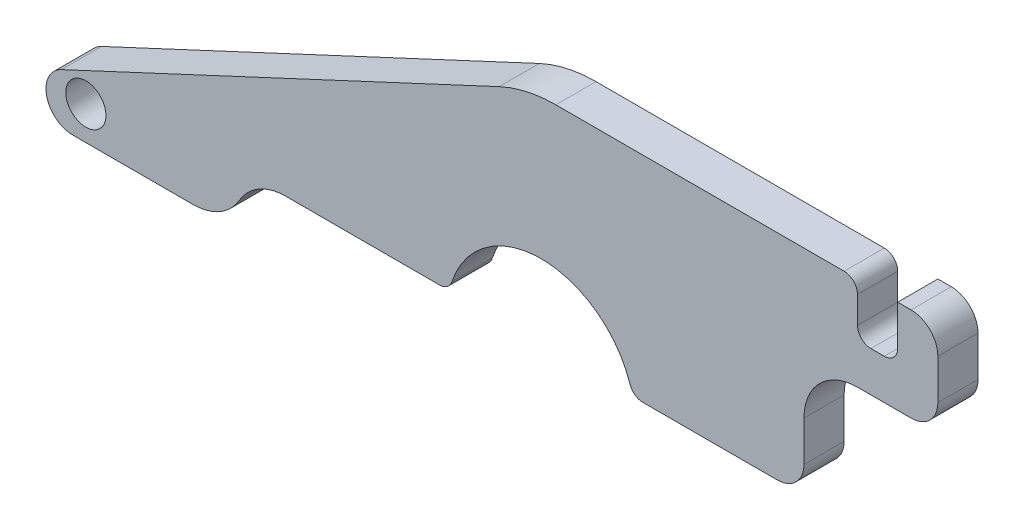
ISO-10303-21;
HEADER;
FILE_DESCRIPTION(('STEP AP214'),'2;1');
FILE_NAME('part.step','',(''),(''),'','','');
FILE_SCHEMA(('AUTOMOTIVE_DESIGN { 1 0 10303 214 1 1 1 1 }'));
ENDSEC;
DATA;
#1=APPLICATION_CONTEXT('core data for automotive mechanical design processes');
#2=APPLICATION_PROTOCOL_DEFINITION('international standard','automotive_design',2000,#1);
#3=PRODUCT_CONTEXT('',#1,'mechanical');
#4=PRODUCT('Part','Part','',(#3));
#5=PRODUCT_RELATED_PRODUCT_CATEGORY('part','',(#4));
#6=PRODUCT_DEFINITION_FORMATION('','',#4);
#7=PRODUCT_DEFINITION_CONTEXT('part definition',#1,'design');
#8=PRODUCT_DEFINITION('design','',#6,#7);
#9=PRODUCT_DEFINITION_SHAPE('','',#8);
#10=(LENGTH_UNIT() NAMED_UNIT(*) SI_UNIT(.MILLI.,.METRE.));
#11=(NAMED_UNIT(*) PLANE_ANGLE_UNIT() SI_UNIT($,.RADIAN.));
#12=(NAMED_UNIT(*) SI_UNIT($,.STERADIAN.) SOLID_ANGLE_UNIT());
#13=UNCERTAINTY_MEASURE_WITH_UNIT(LENGTH_MEASURE(1.E-05),#10,'distance_accuracy_value','');
#14=(GEOMETRIC_REPRESENTATION_CONTEXT(3) GLOBAL_UNCERTAINTY_ASSIGNED_CONTEXT((#13)) GLOBAL_UNIT_ASSIGNED_CONTEXT((#10,
#11,#12)) REPRESENTATION_CONTEXT('',''));
#15=CARTESIAN_POINT('',(0.,0.,0.));
#16=DIRECTION('',(0.,0.,1.));
#17=DIRECTION('',(1.,0.,0.));
#18=AXIS2_PLACEMENT_3D('',#15,#16,#17);
#19=CARTESIAN_POINT('',(4.32006920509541,11.5625,1.5));
#20=DIRECTION('',(0.,-1.,0.));
#21=DIRECTION('',(0.,0.,-1.));
#22=AXIS2_PLACEMENT_3D('',#19,#20,#21);
#23=PLANE('',#22);
#24=DIRECTION('',(0.,0.,-1.));
#25=VECTOR('',#24,1.);
#26=CARTESIAN_POINT('',(4.32006920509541,11.5625,1.5));
#27=LINE('',#26,#25);
#28=CARTESIAN_POINT('',(4.32006920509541,11.5625,0.));
#29=VERTEX_POINT('',#28);
#30=CARTESIAN_POINT('',(4.32006920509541,11.5625,1.5));
#31=VERTEX_POINT('',#30);
#32=EDGE_CURVE('E290',#29,#31,#27,.F.);
#33=ORIENTED_EDGE('',*,*,#32,.T.);
#34=DIRECTION('',(1.,0.,0.));
#35=VECTOR('',#34,1.);
#36=CARTESIAN_POINT('',(4.32006920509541,11.5625,1.5));
#37=LINE('',#36,#35);
#38=CARTESIAN_POINT('',(4.82006920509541,11.5625,1.5));
#39=VERTEX_POINT('',#38);
#40=EDGE_CURVE('E302',#39,#31,#37,.F.);
#41=ORIENTED_EDGE('',*,*,#40,.F.);
#42=DIRECTION('',(0.,0.,-1.));
#43=VECTOR('',#42,1.);
#44=CARTESIAN_POINT('',(4.8200692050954,11.5625,1.5));
#45=LINE('',#44,#43);
#46=CARTESIAN_POINT('',(4.82006920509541,11.5625,0.));
#47=VERTEX_POINT('',#46);
#48=EDGE_CURVE('E286',#39,#47,#45,.T.);
#49=ORIENTED_EDGE('',*,*,#48,.T.);
#50=DIRECTION('',(1.,0.,0.));
#51=VECTOR('',#50,1.);
#52=CARTESIAN_POINT('',(4.32006920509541,11.5625,0.));
#53=LINE('',#52,#51);
#54=EDGE_CURVE('E196',#29,#47,#53,.T.);
#55=ORIENTED_EDGE('',*,*,#54,.F.);
#56=EDGE_LOOP('',(#33,#41,#49,#55));
#57=FACE_BOUND('',#56,.T.);
#58=ADVANCED_FACE('F17',(#57),#23,.F.);
#59=CARTESIAN_POINT('',(-4.2003289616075,6.06250000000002,1.5));
#60=DIRECTION('',(0.,0.,-1.));
#61=DIRECTION('',(-1.,0.,0.));
#62=AXIS2_PLACEMENT_3D('',#59,#60,#61);
#63=CYLINDRICAL_SURFACE('',#62,0.499999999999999);
#64=CARTESIAN_POINT('',(-4.2003289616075,6.06250000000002,1.5));
#65=DIRECTION('',(0.,0.,-1.));
#66=DIRECTION('',(-1.,0.,0.));
#67=AXIS2_PLACEMENT_3D('',#64,#65,#66);
#68=CIRCLE('',#67,0.499999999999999);
#69=CARTESIAN_POINT('',(-4.2003289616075,5.56250000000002,1.5));
#70=VERTEX_POINT('',#69);
#71=CARTESIAN_POINT('',(-4.67528784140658,5.90625000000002,1.5));
#72=VERTEX_POINT('',#71);
#73=EDGE_CURVE('E20',#70,#72,#68,.T.);
#74=ORIENTED_EDGE('',*,*,#73,.T.);
#75=DIRECTION('',(0.,0.,-1.));
#76=VECTOR('',#75,1.);
#77=CARTESIAN_POINT('',(-4.67528784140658,5.90625000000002,1.5));
#78=LINE('',#77,#76);
#79=CARTESIAN_POINT('',(-4.67528784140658,5.90625000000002,0.));
#80=VERTEX_POINT('',#79);
#81=EDGE_CURVE('E192',#72,#80,#78,.T.);
#82=ORIENTED_EDGE('',*,*,#81,.T.);
#83=CARTESIAN_POINT('',(-4.2003289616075,6.06250000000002,0.));
#84=DIRECTION('',(0.,0.,-1.));
#85=DIRECTION('',(-1.,0.,0.));
#86=AXIS2_PLACEMENT_3D('',#83,#84,#85);
#87=CIRCLE('',#86,0.499999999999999);
#88=CARTESIAN_POINT('',(-4.2003289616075,5.56250000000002,0.));
#89=VERTEX_POINT('',#88);
#90=EDGE_CURVE('E280',#89,#80,#87,.T.);
#91=ORIENTED_EDGE('',*,*,#90,.F.);
#92=DIRECTION('',(0.,0.,1.));
#93=VECTOR('',#92,1.);
#94=CARTESIAN_POINT('',(-4.2003289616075,5.56250000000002,1.5));
#95=LINE('',#94,#93);
#96=EDGE_CURVE('E193',#89,#70,#95,.T.);
#97=ORIENTED_EDGE('',*,*,#96,.T.);
#98=EDGE_LOOP('',(#74,#82,#91,#97));
#99=FACE_BOUND('',#98,.T.);
#100=ADVANCED_FACE('F190',(#99),#63,.T.);
#101=CARTESIAN_POINT('',(-11.7996710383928,6.06250000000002,1.5));
#102=DIRECTION('',(0.,0.,-1.));
#103=DIRECTION('',(-1.,0.,0.));
#104=AXIS2_PLACEMENT_3D('',#101,#102,#103);
#105=CYLINDRICAL_SURFACE('',#104,0.5);
#106=CARTESIAN_POINT('',(-11.7996710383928,6.06250000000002,1.5));
#107=DIRECTION('',(0.,0.,-1.));
#108=DIRECTION('',(-1.,0.,0.));
#109=AXIS2_PLACEMENT_3D('',#106,#107,#108);
#110=CIRCLE('',#109,0.5);
#111=CARTESIAN_POINT('',(-11.3247121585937,5.90625000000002,1.5));
#112=VERTEX_POINT('',#111);
#113=CARTESIAN_POINT('',(-11.7996710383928,5.56250000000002,1.5));
#114=VERTEX_POINT('',#113);
#115=EDGE_CURVE('E195',#112,#114,#110,.T.);
#116=ORIENTED_EDGE('',*,*,#115,.T.);
#117=DIRECTION('',(0.,0.,1.));
#118=VECTOR('',#117,1.);
#119=CARTESIAN_POINT('',(-11.7996710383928,5.56250000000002,1.5));
#120=LINE('',#119,#118);
#121=CARTESIAN_POINT('',(-11.7996710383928,5.56250000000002,0.));
#122=VERTEX_POINT('',#121);
#123=EDGE_CURVE('E254',#114,#122,#120,.F.);
#124=ORIENTED_EDGE('',*,*,#123,.T.);
#125=CARTESIAN_POINT('',(-11.7996710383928,6.06250000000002,0.));
#126=DIRECTION('',(0.,0.,-1.));
#127=DIRECTION('',(-1.,0.,0.));
#128=AXIS2_PLACEMENT_3D('',#125,#126,#127);
#129=CIRCLE('',#128,0.5);
#130=CARTESIAN_POINT('',(-11.3247121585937,5.90625000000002,0.));
#131=VERTEX_POINT('',#130);
#132=EDGE_CURVE('E278',#131,#122,#129,.T.);
#133=ORIENTED_EDGE('',*,*,#132,.F.);
#134=DIRECTION('',(0.,0.,-1.));
#135=VECTOR('',#134,1.);
#136=CARTESIAN_POINT('',(-11.3247121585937,5.90625000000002,1.5));
#137=LINE('',#136,#135);
#138=EDGE_CURVE('E204',#131,#112,#137,.F.);
#139=ORIENTED_EDGE('',*,*,#138,.T.);
#140=EDGE_LOOP('',(#116,#124,#133,#139));
#141=FACE_BOUND('',#140,.T.);
#142=ADVANCED_FACE('F430',(#141),#105,.T.);
#143=CARTESIAN_POINT('',(4.32006920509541,12.0625,1.5));
#144=DIRECTION('',(0.,0.,-1.));
#145=DIRECTION('',(-1.,0.,0.));
#146=AXIS2_PLACEMENT_3D('',#143,#144,#145);
#147=CYLINDRICAL_SURFACE('',#146,0.5);
#148=DIRECTION('',(0.,0.,1.));
#149=VECTOR('',#148,1.);
#150=CARTESIAN_POINT('',(3.82006920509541,12.0625,1.5));
#151=LINE('',#150,#149);
#152=CARTESIAN_POINT('',(3.82006920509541,12.0625,0.));
#153=VERTEX_POINT('',#152);
#154=CARTESIAN_POINT('',(3.82006920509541,12.0625,1.5));
#155=VERTEX_POINT('',#154);
#156=EDGE_CURVE('E376',#153,#155,#151,.T.);
#157=ORIENTED_EDGE('',*,*,#156,.T.);
#158=CARTESIAN_POINT('',(4.32006920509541,12.0625,1.5));
#159=DIRECTION('',(0.,0.,-1.));
#160=DIRECTION('',(-1.,0.,0.));
#161=AXIS2_PLACEMENT_3D('',#158,#159,#160);
#162=CIRCLE('',#161,0.5);
#163=EDGE_CURVE('E289',#31,#155,#162,.T.);
#164=ORIENTED_EDGE('',*,*,#163,.F.);
#165=ORIENTED_EDGE('',*,*,#32,.F.);
#166=CARTESIAN_POINT('',(4.32006920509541,12.0625,0.));
#167=DIRECTION('',(0.,0.,-1.));
#168=DIRECTION('',(-1.,0.,0.));
#169=AXIS2_PLACEMENT_3D('',#166,#167,#168);
#170=CIRCLE('',#169,0.5);
#171=EDGE_CURVE('E273',#153,#29,#170,.F.);
#172=ORIENTED_EDGE('',*,*,#171,.F.);
#173=EDGE_LOOP('',(#157,#164,#165,#172));
#174=FACE_BOUND('',#173,.T.);
#175=ADVANCED_FACE('F432',(#174),#147,.F.);
#176=CARTESIAN_POINT('',(3.32006920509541,13.0625,1.5));
#177=DIRECTION('',(0.,0.,-1.));
#178=DIRECTION('',(-1.,0.,0.));
#179=AXIS2_PLACEMENT_3D('',#176,#177,#178);
#180=CYLINDRICAL_SURFACE('',#179,0.5);
#181=CARTESIAN_POINT('',(3.32006920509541,13.0625,1.5));
#182=DIRECTION('',(0.,0.,-1.));
#183=DIRECTION('',(-1.,0.,0.));
#184=AXIS2_PLACEMENT_3D('',#181,#182,#183);
#185=CIRCLE('',#184,0.5);
#186=CARTESIAN_POINT('',(3.32006920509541,13.5625,1.5));
#187=VERTEX_POINT('',#186);
#188=CARTESIAN_POINT('',(3.82006920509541,13.0625,1.5));
#189=VERTEX_POINT('',#188);
#190=EDGE_CURVE('E287',#187,#189,#185,.T.);
#191=ORIENTED_EDGE('',*,*,#190,.T.);
#192=DIRECTION('',(0.,0.,1.));
#193=VECTOR('',#192,1.);
#194=CARTESIAN_POINT('',(3.82006920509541,13.0625,1.5));
#195=LINE('',#194,#193);
#196=CARTESIAN_POINT('',(3.82006920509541,13.0625,0.));
#197=VERTEX_POINT('',#196);
#198=EDGE_CURVE('E372',#189,#197,#195,.F.);
#199=ORIENTED_EDGE('',*,*,#198,.T.);
#200=CARTESIAN_POINT('',(3.32006920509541,13.0625,0.));
#201=DIRECTION('',(0.,0.,-1.));
#202=DIRECTION('',(-1.,0.,0.));
#203=AXIS2_PLACEMENT_3D('',#200,#201,#202);
#204=CIRCLE('',#203,0.5);
#205=CARTESIAN_POINT('',(3.32006920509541,13.5625,0.));
#206=VERTEX_POINT('',#205);
#207=EDGE_CURVE('E276',#206,#197,#204,.T.);
#208=ORIENTED_EDGE('',*,*,#207,.F.);
#209=DIRECTION('',(0.,0.,-1.));
#210=VECTOR('',#209,1.);
#211=CARTESIAN_POINT('',(3.3200692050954,13.5625,1.5));
#212=LINE('',#211,#210);
#213=EDGE_CURVE('E421',#206,#187,#212,.F.);
#214=ORIENTED_EDGE('',*,*,#213,.T.);
#215=EDGE_LOOP('',(#191,#199,#208,#214));
#216=FACE_BOUND('',#215,.T.);
#217=ADVANCED_FACE('F439',(#216),#180,.T.);
#218=CARTESIAN_POINT('',(5.32006920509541,13.5625,1.5));
#219=DIRECTION('',(0.,-1.,0.));
#220=DIRECTION('',(0.,0.,-1.));
#221=AXIS2_PLACEMENT_3D('',#218,#219,#220);
#222=PLANE('',#221);
#223=DIRECTION('',(0.,0.,-1.));
#224=VECTOR('',#223,1.);
#225=CARTESIAN_POINT('',(5.32006920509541,13.5625,1.5));
#226=LINE('',#225,#224);
#227=CARTESIAN_POINT('',(5.32006920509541,13.5625,0.));
#228=VERTEX_POINT('',#227);
#229=CARTESIAN_POINT('',(5.32006920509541,13.5625,1.5));
#230=VERTEX_POINT('',#229);
#231=EDGE_CURVE('E371',#228,#230,#226,.F.);
#232=ORIENTED_EDGE('',*,*,#231,.T.);
#233=DIRECTION('',(1.,0.,0.));
#234=VECTOR('',#233,1.);
#235=CARTESIAN_POINT('',(5.32006920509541,13.5625,1.5));
#236=LINE('',#235,#234);
#237=CARTESIAN_POINT('',(5.8200692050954,13.5625,1.5));
#238=VERTEX_POINT('',#237);
#239=EDGE_CURVE('E35',#238,#230,#236,.F.);
#240=ORIENTED_EDGE('',*,*,#239,.F.);
#241=DIRECTION('',(0.,0.,-1.));
#242=VECTOR('',#241,1.);
#243=CARTESIAN_POINT('',(5.8200692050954,13.5625,1.5));
#244=LINE('',#243,#242);
#245=CARTESIAN_POINT('',(5.8200692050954,13.5625,0.));
#246=VERTEX_POINT('',#245);
#247=EDGE_CURVE('E270',#246,#238,#244,.F.);
#248=ORIENTED_EDGE('',*,*,#247,.F.);
#249=DIRECTION('',(-1.,0.,0.));
#250=VECTOR('',#249,1.);
#251=CARTESIAN_POINT('',(5.82006920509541,13.5625,0.));
#252=LINE('',#251,#250);
#253=EDGE_CURVE('E282',#228,#246,#252,.F.);
#254=ORIENTED_EDGE('',*,*,#253,.F.);
#255=EDGE_LOOP('',(#232,#240,#248,#254));
#256=FACE_BOUND('',#255,.T.);
#257=ADVANCED_FACE('F522',(#256),#222,.F.);
#258=CARTESIAN_POINT('',(4.82006920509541,12.0625,1.5));
#259=DIRECTION('',(0.,0.,-1.));
#260=DIRECTION('',(-1.,0.,0.));
#261=AXIS2_PLACEMENT_3D('',#258,#259,#260);
#262=CYLINDRICAL_SURFACE('',#261,0.5);
#263=ORIENTED_EDGE('',*,*,#48,.F.);
#264=CARTESIAN_POINT('',(4.82006920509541,12.0625,1.5));
#265=DIRECTION('',(0.,0.,-1.));
#266=DIRECTION('',(-1.,0.,0.));
#267=AXIS2_PLACEMENT_3D('',#264,#265,#266);
#268=CIRCLE('',#267,0.5);
#269=CARTESIAN_POINT('',(5.32006920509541,12.0625,1.5));
#270=VERTEX_POINT('',#269);
#271=EDGE_CURVE('E283',#270,#39,#268,.T.);
#272=ORIENTED_EDGE('',*,*,#271,.F.);
#273=DIRECTION('',(0.,0.,-1.));
#274=VECTOR('',#273,1.);
#275=CARTESIAN_POINT('',(5.32006920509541,12.0625,1.5));
#276=LINE('',#275,#274);
#277=CARTESIAN_POINT('',(5.32006920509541,12.0625,0.));
#278=VERTEX_POINT('',#277);
#279=EDGE_CURVE('E362',#270,#278,#276,.T.);
#280=ORIENTED_EDGE('',*,*,#279,.T.);
#281=CARTESIAN_POINT('',(4.82006920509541,12.0625,0.));
#282=DIRECTION('',(0.,0.,-1.));
#283=DIRECTION('',(-1.,0.,0.));
#284=AXIS2_PLACEMENT_3D('',#281,#282,#283);
#285=CIRCLE('',#284,0.5);
#286=EDGE_CURVE('E271',#47,#278,#285,.F.);
#287=ORIENTED_EDGE('',*,*,#286,.F.);
#288=EDGE_LOOP('',(#263,#272,#280,#287));
#289=FACE_BOUND('',#288,.T.);
#290=ADVANCED_FACE('F518',(#289),#262,.F.);
#291=CARTESIAN_POINT('',(5.82006920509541,12.5625,0.));
#292=DIRECTION('',(0.,0.,-1.));
#293=DIRECTION('',(-1.,0.,0.));
#294=AXIS2_PLACEMENT_3D('',#291,#292,#293);
#295=PLANE('',#294);
#296=CARTESIAN_POINT('',(-25.0000000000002,4.81250000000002,0.));
#297=DIRECTION('',(0.,0.,-1.));
#298=DIRECTION('',(-1.,0.,0.));
#299=AXIS2_PLACEMENT_3D('',#296,#297,#298);
#300=CIRCLE('',#299,0.750000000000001);
#301=CARTESIAN_POINT('',(-25.7500000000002,4.81250000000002,0.));
#302=VERTEX_POINT('',#301);
#303=EDGE_CURVE('E234',#302,#302,#300,.F.);
#304=ORIENTED_EDGE('',*,*,#303,.T.);
#305=EDGE_LOOP('',(#304));
#306=FACE_BOUND('',#305,.T.);
#307=ORIENTED_EDGE('',*,*,#286,.T.);
#308=DIRECTION('',(0.,1.,0.));
#309=VECTOR('',#308,1.);
#310=CARTESIAN_POINT('',(5.32006920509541,12.0625,0.));
#311=LINE('',#310,#309);
#312=EDGE_CURVE('E237',#278,#228,#311,.T.);
#313=ORIENTED_EDGE('',*,*,#312,.T.);
#314=ORIENTED_EDGE('',*,*,#253,.T.);
#315=CARTESIAN_POINT('',(5.82006920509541,12.5625,0.));
#316=DIRECTION('',(0.,0.,-1.));
#317=DIRECTION('',(-1.,0.,0.));
#318=AXIS2_PLACEMENT_3D('',#315,#316,#317);
#319=CIRCLE('',#318,1.);
#320=CARTESIAN_POINT('',(6.82006920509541,12.5625,0.));
#321=VERTEX_POINT('',#320);
#322=EDGE_CURVE('E267',#321,#246,#319,.F.);
#323=ORIENTED_EDGE('',*,*,#322,.F.);
#324=DIRECTION('',(0.,-1.,0.));
#325=VECTOR('',#324,1.);
#326=CARTESIAN_POINT('',(6.82006920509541,12.5625,0.));
#327=LINE('',#326,#325);
#328=CARTESIAN_POINT('',(6.82006920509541,11.0625,0.));
#329=VERTEX_POINT('',#328);
#330=EDGE_CURVE('E266',#321,#329,#327,.T.);
#331=ORIENTED_EDGE('',*,*,#330,.T.);
#332=CARTESIAN_POINT('',(5.82006920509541,11.0625,0.));
#333=DIRECTION('',(0.,0.,-1.));
#334=DIRECTION('',(-1.,0.,0.));
#335=AXIS2_PLACEMENT_3D('',#332,#333,#334);
#336=CIRCLE('',#335,0.999999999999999);
#337=CARTESIAN_POINT('',(5.8200692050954,10.0625,0.));
#338=VERTEX_POINT('',#337);
#339=EDGE_CURVE('E263',#338,#329,#336,.F.);
#340=ORIENTED_EDGE('',*,*,#339,.F.);
#341=DIRECTION('',(-1.,0.,0.));
#342=VECTOR('',#341,1.);
#343=CARTESIAN_POINT('',(5.8200692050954,10.0625,0.));
#344=LINE('',#343,#342);
#345=CARTESIAN_POINT('',(3.82006920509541,10.0625,0.));
#346=VERTEX_POINT('',#345);
#347=EDGE_CURVE('E347',#338,#346,#344,.T.);
#348=ORIENTED_EDGE('',*,*,#347,.T.);
#349=CARTESIAN_POINT('',(3.82006920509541,8.06250000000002,0.));
#350=DIRECTION('',(0.,0.,-1.));
#351=DIRECTION('',(-1.,0.,0.));
#352=AXIS2_PLACEMENT_3D('',#349,#350,#351);
#353=CIRCLE('',#352,2.);
#354=CARTESIAN_POINT('',(1.82006920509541,8.06250000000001,0.));
#355=VERTEX_POINT('',#354);
#356=EDGE_CURVE('E259',#346,#355,#353,.F.);
#357=ORIENTED_EDGE('',*,*,#356,.T.);
#358=DIRECTION('',(0.,-1.,0.));
#359=VECTOR('',#358,1.);
#360=CARTESIAN_POINT('',(1.82006920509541,8.0625,0.));
#361=LINE('',#360,#359);
#362=CARTESIAN_POINT('',(1.8200692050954,6.56250000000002,0.));
#363=VERTEX_POINT('',#362);
#364=EDGE_CURVE('E258',#355,#363,#361,.T.);
#365=ORIENTED_EDGE('',*,*,#364,.T.);
#366=CARTESIAN_POINT('',(0.820069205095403,6.56250000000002,0.));
#367=DIRECTION('',(0.,0.,-1.));
#368=DIRECTION('',(-1.,0.,0.));
#369=AXIS2_PLACEMENT_3D('',#366,#367,#368);
#370=CIRCLE('',#369,1.);
#371=CARTESIAN_POINT('',(0.820069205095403,5.56250000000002,0.));
#372=VERTEX_POINT('',#371);
#373=EDGE_CURVE('E255',#372,#363,#370,.F.);
#374=ORIENTED_EDGE('',*,*,#373,.F.);
#375=DIRECTION('',(1.,0.,0.));
#376=VECTOR('',#375,1.);
#377=CARTESIAN_POINT('',(0.820069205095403,5.56250000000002,0.));
#378=LINE('',#377,#376);
#379=EDGE_CURVE('E336',#372,#89,#378,.F.);
#380=ORIENTED_EDGE('',*,*,#379,.T.);
#381=ORIENTED_EDGE('',*,*,#90,.T.);
#382=CARTESIAN_POINT('',(-8.00000000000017,4.81250000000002,0.));
#383=DIRECTION('',(0.,0.,-1.));
#384=DIRECTION('',(-1.,0.,0.));
#385=AXIS2_PLACEMENT_3D('',#382,#383,#384);
#386=CIRCLE('',#385,3.5);
#387=EDGE_CURVE('E203',#80,#131,#386,.F.);
#388=ORIENTED_EDGE('',*,*,#387,.T.);
#389=ORIENTED_EDGE('',*,*,#132,.T.);
#390=DIRECTION('',(-1.,0.,0.));
#391=VECTOR('',#390,1.);
#392=CARTESIAN_POINT('',(-11.7996710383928,5.56250000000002,0.));
#393=LINE('',#392,#391);
#394=CARTESIAN_POINT('',(-17.5358983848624,5.56250000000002,0.));
#395=VERTEX_POINT('',#394);
#396=EDGE_CURVE('E329',#122,#395,#393,.T.);
#397=ORIENTED_EDGE('',*,*,#396,.T.);
#398=CARTESIAN_POINT('',(-17.5358983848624,3.56250000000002,0.));
#399=DIRECTION('',(0.,0.,-1.));
#400=DIRECTION('',(-1.,0.,0.));
#401=AXIS2_PLACEMENT_3D('',#398,#399,#400);
#402=CIRCLE('',#401,2.);
#403=CARTESIAN_POINT('',(-19.2679491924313,4.56250000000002,0.));
#404=VERTEX_POINT('',#403);
#405=EDGE_CURVE('E249',#395,#404,#402,.F.);
#406=ORIENTED_EDGE('',*,*,#405,.T.);
#407=CARTESIAN_POINT('',(-21.0000000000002,5.56250000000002,0.));
#408=DIRECTION('',(0.,0.,-1.));
#409=DIRECTION('',(-1.,0.,0.));
#410=AXIS2_PLACEMENT_3D('',#407,#408,#409);
#411=CIRCLE('',#410,2.);
#412=CARTESIAN_POINT('',(-21.0000000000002,3.56250000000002,0.));
#413=VERTEX_POINT('',#412);
#414=EDGE_CURVE('E246',#413,#404,#411,.F.);
#415=ORIENTED_EDGE('',*,*,#414,.F.);
#416=DIRECTION('',(-1.,0.,0.));
#417=VECTOR('',#416,1.);
#418=CARTESIAN_POINT('',(-25.4892914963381,3.56250000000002,0.));
#419=LINE('',#418,#417);
#420=CARTESIAN_POINT('',(-25.4892914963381,3.56250000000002,0.));
#421=VERTEX_POINT('',#420);
#422=EDGE_CURVE('E380',#413,#421,#419,.T.);
#423=ORIENTED_EDGE('',*,*,#422,.T.);
#424=CARTESIAN_POINT('',(-25.4892914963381,4.56250000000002,0.));
#425=DIRECTION('',(0.,0.,-1.));
#426=DIRECTION('',(-1.,0.,0.));
#427=AXIS2_PLACEMENT_3D('',#424,#425,#426);
#428=CIRCLE('',#427,1.);
#429=CARTESIAN_POINT('',(-25.9119097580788,5.46880778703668,0.));
#430=VERTEX_POINT('',#429);
#431=EDGE_CURVE('E242',#430,#421,#428,.F.);
#432=ORIENTED_EDGE('',*,*,#431,.F.);
#433=DIRECTION('',(0.906307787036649,0.422618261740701,0.));
#434=VECTOR('',#433,1.);
#435=CARTESIAN_POINT('',(-25.9119097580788,5.4688077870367,0.));
#436=LINE('',#435,#434);
#437=CARTESIAN_POINT('',(-9.55954879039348,13.0940389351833,0.));
#438=VERTEX_POINT('',#437);
#439=EDGE_CURVE('E241',#430,#438,#436,.T.);
#440=ORIENTED_EDGE('',*,*,#439,.T.);
#441=CARTESIAN_POINT('',(-7.44645748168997,8.56250000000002,0.));
#442=DIRECTION('',(0.,0.,-1.));
#443=DIRECTION('',(-1.,0.,0.));
#444=AXIS2_PLACEMENT_3D('',#441,#442,#443);
#445=CIRCLE('',#444,5.);
#446=CARTESIAN_POINT('',(-7.44645748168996,13.5625,0.));
#447=VERTEX_POINT('',#446);
#448=EDGE_CURVE('E238',#447,#438,#445,.F.);
#449=ORIENTED_EDGE('',*,*,#448,.F.);
#450=DIRECTION('',(1.,0.,0.));
#451=VECTOR('',#450,1.);
#452=CARTESIAN_POINT('',(-7.44645748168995,13.5625,0.));
#453=LINE('',#452,#451);
#454=EDGE_CURVE('E373',#447,#206,#453,.T.);
#455=ORIENTED_EDGE('',*,*,#454,.T.);
#456=ORIENTED_EDGE('',*,*,#207,.T.);
#457=DIRECTION('',(0.,-1.,0.));
#458=VECTOR('',#457,1.);
#459=CARTESIAN_POINT('',(3.82006920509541,13.0625,0.));
#460=LINE('',#459,#458);
#461=EDGE_CURVE('E368',#197,#153,#460,.T.);
#462=ORIENTED_EDGE('',*,*,#461,.T.);
#463=ORIENTED_EDGE('',*,*,#171,.T.);
#464=ORIENTED_EDGE('',*,*,#54,.T.);
#465=EDGE_LOOP('',(#307,#313,#314,#323,#331,#340,#348,#357,#365,#374,#380,#381,#388,#389,#397,
#406,#415,#423,#432,#440,#449,#455,#456,#462,#463,#464));
#466=FACE_BOUND('',#465,.T.);
#467=ADVANCED_FACE('F392',(#306,#466),#295,.T.);
#468=CARTESIAN_POINT('',(5.82006920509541,12.5625,1.5));
#469=DIRECTION('',(0.,0.,-1.));
#470=DIRECTION('',(-1.,0.,0.));
#471=AXIS2_PLACEMENT_3D('',#468,#469,#470);
#472=CYLINDRICAL_SURFACE('',#471,1.);
#473=CARTESIAN_POINT('',(5.82006920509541,12.5625,1.5));
#474=DIRECTION('',(0.,0.,-1.));
#475=DIRECTION('',(-1.,0.,0.));
#476=AXIS2_PLACEMENT_3D('',#473,#474,#475);
#477=CIRCLE('',#476,1.);
#478=CARTESIAN_POINT('',(6.82006920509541,12.5625,1.5));
#479=VERTEX_POINT('',#478);
#480=EDGE_CURVE('E231',#238,#479,#477,.T.);
#481=ORIENTED_EDGE('',*,*,#480,.T.);
#482=DIRECTION('',(0.,0.,1.));
#483=VECTOR('',#482,1.);
#484=CARTESIAN_POINT('',(6.82006920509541,12.5625,1.5));
#485=LINE('',#484,#483);
#486=EDGE_CURVE('E352',#479,#321,#485,.F.);
#487=ORIENTED_EDGE('',*,*,#486,.T.);
#488=ORIENTED_EDGE('',*,*,#322,.T.);
#489=ORIENTED_EDGE('',*,*,#247,.T.);
#490=EDGE_LOOP('',(#481,#487,#488,#489));
#491=FACE_BOUND('',#490,.T.);
#492=ADVANCED_FACE('F512',(#491),#472,.T.);
#493=CARTESIAN_POINT('',(6.82006920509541,12.5625,1.5));
#494=DIRECTION('',(-1.,0.,0.));
#495=DIRECTION('',(0.,-1.,0.));
#496=AXIS2_PLACEMENT_3D('',#493,#494,#495);
#497=PLANE('',#496);
#498=ORIENTED_EDGE('',*,*,#486,.F.);
#499=DIRECTION('',(0.,1.,0.));
#500=VECTOR('',#499,1.);
#501=CARTESIAN_POINT('',(6.82006920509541,12.5625,1.5));
#502=LINE('',#501,#500);
#503=CARTESIAN_POINT('',(6.82006920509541,11.0625,1.5));
#504=VERTEX_POINT('',#503);
#505=EDGE_CURVE('E230',#479,#504,#502,.F.);
#506=ORIENTED_EDGE('',*,*,#505,.T.);
#507=DIRECTION('',(0.,0.,-1.));
#508=VECTOR('',#507,1.);
#509=CARTESIAN_POINT('',(6.82006920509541,11.0625,1.5));
#510=LINE('',#509,#508);
#511=EDGE_CURVE('E265',#329,#504,#510,.F.);
#512=ORIENTED_EDGE('',*,*,#511,.F.);
#513=ORIENTED_EDGE('',*,*,#330,.F.);
#514=EDGE_LOOP('',(#498,#506,#512,#513));
#515=FACE_BOUND('',#514,.T.);
#516=ADVANCED_FACE('F396',(#515),#497,.F.);
#517=CARTESIAN_POINT('',(5.82006920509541,11.0625,1.5));
#518=DIRECTION('',(0.,0.,-1.));
#519=DIRECTION('',(-1.,0.,0.));
#520=AXIS2_PLACEMENT_3D('',#517,#518,#519);
#521=CYLINDRICAL_SURFACE('',#520,0.999999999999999);
#522=CARTESIAN_POINT('',(5.82006920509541,11.0625,1.5));
#523=DIRECTION('',(0.,0.,-1.));
#524=DIRECTION('',(-1.,0.,0.));
#525=AXIS2_PLACEMENT_3D('',#522,#523,#524);
#526=CIRCLE('',#525,0.999999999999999);
#527=CARTESIAN_POINT('',(5.8200692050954,10.0625,1.5));
#528=VERTEX_POINT('',#527);
#529=EDGE_CURVE('E227',#504,#528,#526,.T.);
#530=ORIENTED_EDGE('',*,*,#529,.T.);
#531=DIRECTION('',(0.,0.,1.));
#532=VECTOR('',#531,1.);
#533=CARTESIAN_POINT('',(5.8200692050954,10.0625,1.5));
#534=LINE('',#533,#532);
#535=EDGE_CURVE('E348',#528,#338,#534,.F.);
#536=ORIENTED_EDGE('',*,*,#535,.T.);
#537=ORIENTED_EDGE('',*,*,#339,.T.);
#538=ORIENTED_EDGE('',*,*,#511,.T.);
#539=EDGE_LOOP('',(#530,#536,#537,#538));
#540=FACE_BOUND('',#539,.T.);
#541=ADVANCED_FACE('F400',(#540),#521,.T.);
#542=CARTESIAN_POINT('',(5.8200692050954,10.0625,1.5));
#543=DIRECTION('',(0.,1.,0.));
#544=DIRECTION('',(-1.,0.,0.));
#545=AXIS2_PLACEMENT_3D('',#542,#543,#544);
#546=PLANE('',#545);
#547=ORIENTED_EDGE('',*,*,#535,.F.);
#548=DIRECTION('',(-1.,0.,0.));
#549=VECTOR('',#548,1.);
#550=CARTESIAN_POINT('',(5.82006920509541,10.0625,1.5));
#551=LINE('',#550,#549);
#552=CARTESIAN_POINT('',(3.82006920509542,10.0625,1.5));
#553=VERTEX_POINT('',#552);
#554=EDGE_CURVE('E226',#528,#553,#551,.T.);
#555=ORIENTED_EDGE('',*,*,#554,.T.);
#556=DIRECTION('',(0.,0.,-1.));
#557=VECTOR('',#556,1.);
#558=CARTESIAN_POINT('',(3.82006920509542,10.0625,1.5));
#559=LINE('',#558,#557);
#560=EDGE_CURVE('E262',#553,#346,#559,.T.);
#561=ORIENTED_EDGE('',*,*,#560,.T.);
#562=ORIENTED_EDGE('',*,*,#347,.F.);
#563=EDGE_LOOP('',(#547,#555,#561,#562));
#564=FACE_BOUND('',#563,.T.);
#565=ADVANCED_FACE('F504',(#564),#546,.F.);
#566=CARTESIAN_POINT('',(3.82006920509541,8.06250000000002,1.5));
#567=DIRECTION('',(0.,0.,-1.));
#568=DIRECTION('',(-1.,0.,0.));
#569=AXIS2_PLACEMENT_3D('',#566,#567,#568);
#570=CYLINDRICAL_SURFACE('',#569,2.);
#571=ORIENTED_EDGE('',*,*,#560,.F.);
#572=CARTESIAN_POINT('',(3.82006920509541,8.06250000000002,1.5));
#573=DIRECTION('',(0.,0.,-1.));
#574=DIRECTION('',(-1.,0.,0.));
#575=AXIS2_PLACEMENT_3D('',#572,#573,#574);
#576=CIRCLE('',#575,2.);
#577=CARTESIAN_POINT('',(1.82006920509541,8.06250000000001,1.5));
#578=VERTEX_POINT('',#577);
#579=EDGE_CURVE('E223',#553,#578,#576,.F.);
#580=ORIENTED_EDGE('',*,*,#579,.T.);
#581=DIRECTION('',(0.,0.,1.));
#582=VECTOR('',#581,1.);
#583=CARTESIAN_POINT('',(1.82006920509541,8.0625,1.5));
#584=LINE('',#583,#582);
#585=EDGE_CURVE('E261',#578,#355,#584,.F.);
#586=ORIENTED_EDGE('',*,*,#585,.T.);
#587=ORIENTED_EDGE('',*,*,#356,.F.);
#588=EDGE_LOOP('',(#571,#580,#586,#587));
#589=FACE_BOUND('',#588,.T.);
#590=ADVANCED_FACE('F500',(#589),#570,.F.);
#591=CARTESIAN_POINT('',(1.82006920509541,8.0625,1.5));
#592=DIRECTION('',(-1.,0.,0.));
#593=DIRECTION('',(0.,-1.,0.));
#594=AXIS2_PLACEMENT_3D('',#591,#592,#593);
#595=PLANE('',#594);
#596=ORIENTED_EDGE('',*,*,#585,.F.);
#597=DIRECTION('',(0.,1.,0.));
#598=VECTOR('',#597,1.);
#599=CARTESIAN_POINT('',(1.82006920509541,12.5625,1.5));
#600=LINE('',#599,#598);
#601=CARTESIAN_POINT('',(1.82006920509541,6.56250000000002,1.5));
#602=VERTEX_POINT('',#601);
#603=EDGE_CURVE('E222',#578,#602,#600,.F.);
#604=ORIENTED_EDGE('',*,*,#603,.T.);
#605=DIRECTION('',(0.,0.,-1.));
#606=VECTOR('',#605,1.);
#607=CARTESIAN_POINT('',(1.8200692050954,6.56250000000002,1.5));
#608=LINE('',#607,#606);
#609=EDGE_CURVE('E257',#363,#602,#608,.F.);
#610=ORIENTED_EDGE('',*,*,#609,.F.);
#611=ORIENTED_EDGE('',*,*,#364,.F.);
#612=EDGE_LOOP('',(#596,#604,#610,#611));
#613=FACE_BOUND('',#612,.T.);
#614=ADVANCED_FACE('F496',(#613),#595,.F.);
#615=CARTESIAN_POINT('',(0.820069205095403,6.56250000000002,1.5));
#616=DIRECTION('',(0.,0.,-1.));
#617=DIRECTION('',(-1.,0.,0.));
#618=AXIS2_PLACEMENT_3D('',#615,#616,#617);
#619=CYLINDRICAL_SURFACE('',#618,1.);
#620=CARTESIAN_POINT('',(0.820069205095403,6.56250000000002,1.5));
#621=DIRECTION('',(0.,0.,-1.));
#622=DIRECTION('',(-1.,0.,0.));
#623=AXIS2_PLACEMENT_3D('',#620,#621,#622);
#624=CIRCLE('',#623,1.);
#625=CARTESIAN_POINT('',(0.820069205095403,5.56250000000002,1.5));
#626=VERTEX_POINT('',#625);
#627=EDGE_CURVE('E215',#602,#626,#624,.T.);
#628=ORIENTED_EDGE('',*,*,#627,.T.);
#629=DIRECTION('',(0.,0.,1.));
#630=VECTOR('',#629,1.);
#631=CARTESIAN_POINT('',(0.820069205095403,5.56250000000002,1.5));
#632=LINE('',#631,#630);
#633=EDGE_CURVE('E338',#626,#372,#632,.F.);
#634=ORIENTED_EDGE('',*,*,#633,.T.);
#635=ORIENTED_EDGE('',*,*,#373,.T.);
#636=ORIENTED_EDGE('',*,*,#609,.T.);
#637=EDGE_LOOP('',(#628,#634,#635,#636));
#638=FACE_BOUND('',#637,.T.);
#639=ADVANCED_FACE('F492',(#638),#619,.T.);
#640=CARTESIAN_POINT('',(0.820069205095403,5.56250000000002,1.5));
#641=DIRECTION('',(0.,1.,0.));
#642=DIRECTION('',(0.,0.,1.));
#643=AXIS2_PLACEMENT_3D('',#640,#641,#642);
#644=PLANE('',#643);
#645=ORIENTED_EDGE('',*,*,#633,.F.);
#646=DIRECTION('',(-1.,0.,0.));
#647=VECTOR('',#646,1.);
#648=CARTESIAN_POINT('',(5.82006920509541,5.56250000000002,1.5));
#649=LINE('',#648,#647);
#650=EDGE_CURVE('E210',#626,#70,#649,.T.);
#651=ORIENTED_EDGE('',*,*,#650,.T.);
#652=ORIENTED_EDGE('',*,*,#96,.F.);
#653=ORIENTED_EDGE('',*,*,#379,.F.);
#654=EDGE_LOOP('',(#645,#651,#652,#653));
#655=FACE_BOUND('',#654,.T.);
#656=ADVANCED_FACE('F489',(#655),#644,.F.);
#657=CARTESIAN_POINT('',(-8.00000000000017,4.81250000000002,1.5));
#658=DIRECTION('',(0.,0.,-1.));
#659=DIRECTION('',(-1.,0.,0.));
#660=AXIS2_PLACEMENT_3D('',#657,#658,#659);
#661=CYLINDRICAL_SURFACE('',#660,3.5);
#662=ORIENTED_EDGE('',*,*,#81,.F.);
#663=CARTESIAN_POINT('',(-8.00000000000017,4.81250000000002,1.5));
#664=DIRECTION('',(0.,0.,-1.));
#665=DIRECTION('',(-1.,0.,0.));
#666=AXIS2_PLACEMENT_3D('',#663,#664,#665);
#667=CIRCLE('',#666,3.5);
#668=EDGE_CURVE('E201',#72,#112,#667,.F.);
#669=ORIENTED_EDGE('',*,*,#668,.T.);
#670=ORIENTED_EDGE('',*,*,#138,.F.);
#671=ORIENTED_EDGE('',*,*,#387,.F.);
#672=EDGE_LOOP('',(#662,#669,#670,#671));
#673=FACE_BOUND('',#672,.T.);
#674=ADVANCED_FACE('F200',(#673),#661,.F.);
#675=CARTESIAN_POINT('',(-11.7996710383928,5.56250000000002,1.5));
#676=DIRECTION('',(0.,1.,0.));
#677=DIRECTION('',(-1.,0.,0.));
#678=AXIS2_PLACEMENT_3D('',#675,#676,#677);
#679=PLANE('',#678);
#680=ORIENTED_EDGE('',*,*,#123,.F.);
#681=DIRECTION('',(-1.,0.,0.));
#682=VECTOR('',#681,1.);
#683=CARTESIAN_POINT('',(5.82006920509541,5.56250000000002,1.5));
#684=LINE('',#683,#682);
#685=CARTESIAN_POINT('',(-17.5358983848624,5.56250000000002,1.5));
#686=VERTEX_POINT('',#685);
#687=EDGE_CURVE('E209',#114,#686,#684,.T.);
#688=ORIENTED_EDGE('',*,*,#687,.T.);
#689=DIRECTION('',(0.,0.,-1.));
#690=VECTOR('',#689,1.);
#691=CARTESIAN_POINT('',(-17.5358983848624,5.56250000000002,1.5));
#692=LINE('',#691,#690);
#693=EDGE_CURVE('E252',#686,#395,#692,.T.);
#694=ORIENTED_EDGE('',*,*,#693,.T.);
#695=ORIENTED_EDGE('',*,*,#396,.F.);
#696=EDGE_LOOP('',(#680,#688,#694,#695));
#697=FACE_BOUND('',#696,.T.);
#698=ADVANCED_FACE('F327',(#697),#679,.F.);
#699=CARTESIAN_POINT('',(-17.5358983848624,3.56250000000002,1.5));
#700=DIRECTION('',(0.,0.,-1.));
#701=DIRECTION('',(-1.,0.,0.));
#702=AXIS2_PLACEMENT_3D('',#699,#700,#701);
#703=CYLINDRICAL_SURFACE('',#702,2.);
#704=ORIENTED_EDGE('',*,*,#693,.F.);
#705=CARTESIAN_POINT('',(-17.5358983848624,3.56250000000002,1.5));
#706=DIRECTION('',(0.,0.,-1.));
#707=DIRECTION('',(-1.,0.,0.));
#708=AXIS2_PLACEMENT_3D('',#705,#706,#707);
#709=CIRCLE('',#708,2.);
#710=CARTESIAN_POINT('',(-19.2679491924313,4.56250000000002,1.5));
#711=VERTEX_POINT('',#710);
#712=EDGE_CURVE('E213',#686,#711,#709,.F.);
#713=ORIENTED_EDGE('',*,*,#712,.T.);
#714=DIRECTION('',(0.,0.,-1.));
#715=VECTOR('',#714,1.);
#716=CARTESIAN_POINT('',(-19.2679491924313,4.56250000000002,1.5));
#717=LINE('',#716,#715);
#718=EDGE_CURVE('E248',#404,#711,#717,.F.);
#719=ORIENTED_EDGE('',*,*,#718,.F.);
#720=ORIENTED_EDGE('',*,*,#405,.F.);
#721=EDGE_LOOP('',(#704,#713,#719,#720));
#722=FACE_BOUND('',#721,.T.);
#723=ADVANCED_FACE('F322',(#722),#703,.F.);
#724=CARTESIAN_POINT('',(-21.0000000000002,5.56250000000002,1.5));
#725=DIRECTION('',(0.,0.,-1.));
#726=DIRECTION('',(-1.,0.,0.));
#727=AXIS2_PLACEMENT_3D('',#724,#725,#726);
#728=CYLINDRICAL_SURFACE('',#727,2.);
#729=CARTESIAN_POINT('',(-21.0000000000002,5.56250000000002,1.5));
#730=DIRECTION('',(0.,0.,-1.));
#731=DIRECTION('',(-1.,0.,0.));
#732=AXIS2_PLACEMENT_3D('',#729,#730,#731);
#733=CIRCLE('',#732,2.);
#734=CARTESIAN_POINT('',(-21.0000000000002,3.56250000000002,1.5));
#735=VERTEX_POINT('',#734);
#736=EDGE_CURVE('E311',#711,#735,#733,.T.);
#737=ORIENTED_EDGE('',*,*,#736,.T.);
#738=DIRECTION('',(0.,0.,1.));
#739=VECTOR('',#738,1.);
#740=CARTESIAN_POINT('',(-21.0000000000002,3.56250000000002,1.5));
#741=LINE('',#740,#739);
#742=EDGE_CURVE('E382',#735,#413,#741,.F.);
#743=ORIENTED_EDGE('',*,*,#742,.T.);
#744=ORIENTED_EDGE('',*,*,#414,.T.);
#745=ORIENTED_EDGE('',*,*,#718,.T.);
#746=EDGE_LOOP('',(#737,#743,#744,#745));
#747=FACE_BOUND('',#746,.T.);
#748=ADVANCED_FACE('F428',(#747),#728,.T.);
#749=CARTESIAN_POINT('',(-25.4892914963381,3.56250000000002,1.5));
#750=DIRECTION('',(0.,1.,0.));
#751=DIRECTION('',(-1.,0.,0.));
#752=AXIS2_PLACEMENT_3D('',#749,#750,#751);
#753=PLANE('',#752);
#754=ORIENTED_EDGE('',*,*,#742,.F.);
#755=DIRECTION('',(-1.,0.,0.));
#756=VECTOR('',#755,1.);
#757=CARTESIAN_POINT('',(5.82006920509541,3.56250000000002,1.5));
#758=LINE('',#757,#756);
#759=CARTESIAN_POINT('',(-25.4892914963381,3.56250000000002,1.5));
#760=VERTEX_POINT('',#759);
#761=EDGE_CURVE('E310',#735,#760,#758,.T.);
#762=ORIENTED_EDGE('',*,*,#761,.T.);
#763=DIRECTION('',(0.,0.,-1.));
#764=VECTOR('',#763,1.);
#765=CARTESIAN_POINT('',(-25.4892914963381,3.56250000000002,1.5));
#766=LINE('',#765,#764);
#767=EDGE_CURVE('E245',#421,#760,#766,.F.);
#768=ORIENTED_EDGE('',*,*,#767,.F.);
#769=ORIENTED_EDGE('',*,*,#422,.F.);
#770=EDGE_LOOP('',(#754,#762,#768,#769));
#771=FACE_BOUND('',#770,.T.);
#772=ADVANCED_FACE('F476',(#771),#753,.F.);
#773=CARTESIAN_POINT('',(-25.4892914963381,4.56250000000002,1.5));
#774=DIRECTION('',(0.,0.,-1.));
#775=DIRECTION('',(-1.,0.,0.));
#776=AXIS2_PLACEMENT_3D('',#773,#774,#775);
#777=CYLINDRICAL_SURFACE('',#776,1.);
#778=DIRECTION('',(0.,0.,1.));
#779=VECTOR('',#778,1.);
#780=CARTESIAN_POINT('',(-25.9119097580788,5.4688077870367,1.5));
#781=LINE('',#780,#779);
#782=CARTESIAN_POINT('',(-25.9119097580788,5.46880778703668,1.5));
#783=VERTEX_POINT('',#782);
#784=EDGE_CURVE('E244',#783,#430,#781,.F.);
#785=ORIENTED_EDGE('',*,*,#784,.T.);
#786=ORIENTED_EDGE('',*,*,#431,.T.);
#787=ORIENTED_EDGE('',*,*,#767,.T.);
#788=CARTESIAN_POINT('',(-25.4892914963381,4.56250000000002,1.5));
#789=DIRECTION('',(0.,0.,-1.));
#790=DIRECTION('',(-1.,0.,0.));
#791=AXIS2_PLACEMENT_3D('',#788,#789,#790);
#792=CIRCLE('',#791,1.);
#793=EDGE_CURVE('E309',#760,#783,#792,.T.);
#794=ORIENTED_EDGE('',*,*,#793,.T.);
#795=EDGE_LOOP('',(#785,#786,#787,#794));
#796=FACE_BOUND('',#795,.T.);
#797=ADVANCED_FACE('F472',(#796),#777,.T.);
#798=CARTESIAN_POINT('',(-25.9119097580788,5.4688077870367,1.5));
#799=DIRECTION('',(0.422618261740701,-0.906307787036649,0.));
#800=DIRECTION('',(0.906307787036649,0.422618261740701,0.));
#801=AXIS2_PLACEMENT_3D('',#798,#799,#800);
#802=PLANE('',#801);
#803=ORIENTED_EDGE('',*,*,#784,.F.);
#804=DIRECTION('',(0.906307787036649,0.422618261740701,0.));
#805=VECTOR('',#804,1.);
#806=CARTESIAN_POINT('',(-25.9119097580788,5.4688077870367,1.5));
#807=LINE('',#806,#805);
#808=CARTESIAN_POINT('',(-9.55954879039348,13.0940389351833,1.5));
#809=VERTEX_POINT('',#808);
#810=EDGE_CURVE('E308',#783,#809,#807,.T.);
#811=ORIENTED_EDGE('',*,*,#810,.T.);
#812=DIRECTION('',(0.,0.,-1.));
#813=VECTOR('',#812,1.);
#814=CARTESIAN_POINT('',(-9.55954879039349,13.0940389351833,1.5));
#815=LINE('',#814,#813);
#816=EDGE_CURVE('E240',#438,#809,#815,.F.);
#817=ORIENTED_EDGE('',*,*,#816,.F.);
#818=ORIENTED_EDGE('',*,*,#439,.F.);
#819=EDGE_LOOP('',(#803,#811,#817,#818));
#820=FACE_BOUND('',#819,.T.);
#821=ADVANCED_FACE('F468',(#820),#802,.F.);
#822=CARTESIAN_POINT('',(-7.44645748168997,8.56250000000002,1.5));
#823=DIRECTION('',(0.,0.,-1.));
#824=DIRECTION('',(-1.,0.,0.));
#825=AXIS2_PLACEMENT_3D('',#822,#823,#824);
#826=CYLINDRICAL_SURFACE('',#825,5.);
#827=CARTESIAN_POINT('',(-7.44645748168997,8.56250000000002,1.5));
#828=DIRECTION('',(0.,0.,-1.));
#829=DIRECTION('',(-1.,0.,0.));
#830=AXIS2_PLACEMENT_3D('',#827,#828,#829);
#831=CIRCLE('',#830,5.);
#832=CARTESIAN_POINT('',(-7.44645748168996,13.5625,1.5));
#833=VERTEX_POINT('',#832);
#834=EDGE_CURVE('E304',#809,#833,#831,.T.);
#835=ORIENTED_EDGE('',*,*,#834,.T.);
#836=DIRECTION('',(0.,0.,-1.));
#837=VECTOR('',#836,1.);
#838=CARTESIAN_POINT('',(-7.44645748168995,13.5625,1.5));
#839=LINE('',#838,#837);
#840=EDGE_CURVE('E377',#833,#447,#839,.T.);
#841=ORIENTED_EDGE('',*,*,#840,.T.);
#842=ORIENTED_EDGE('',*,*,#448,.T.);
#843=ORIENTED_EDGE('',*,*,#816,.T.);
#844=EDGE_LOOP('',(#835,#841,#842,#843));
#845=FACE_BOUND('',#844,.T.);
#846=ADVANCED_FACE('F464',(#845),#826,.T.);
#847=CARTESIAN_POINT('',(-7.44645748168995,13.5625,1.5));
#848=DIRECTION('',(0.,-1.,0.));
#849=DIRECTION('',(0.,0.,-1.));
#850=AXIS2_PLACEMENT_3D('',#847,#848,#849);
#851=PLANE('',#850);
#852=ORIENTED_EDGE('',*,*,#840,.F.);
#853=DIRECTION('',(-1.,0.,0.));
#854=VECTOR('',#853,1.);
#855=CARTESIAN_POINT('',(5.82006920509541,13.5625,1.5));
#856=LINE('',#855,#854);
#857=EDGE_CURVE('E307',#833,#187,#856,.F.);
#858=ORIENTED_EDGE('',*,*,#857,.T.);
#859=ORIENTED_EDGE('',*,*,#213,.F.);
#860=ORIENTED_EDGE('',*,*,#454,.F.);
#861=EDGE_LOOP('',(#852,#858,#859,#860));
#862=FACE_BOUND('',#861,.T.);
#863=ADVANCED_FACE('F460',(#862),#851,.F.);
#864=CARTESIAN_POINT('',(3.82006920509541,13.0625,1.5));
#865=DIRECTION('',(-1.,0.,0.));
#866=DIRECTION('',(0.,-1.,0.));
#867=AXIS2_PLACEMENT_3D('',#864,#865,#866);
#868=PLANE('',#867);
#869=ORIENTED_EDGE('',*,*,#198,.F.);
#870=DIRECTION('',(0.,1.,0.));
#871=VECTOR('',#870,1.);
#872=CARTESIAN_POINT('',(3.82006920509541,12.5625,1.5));
#873=LINE('',#872,#871);
#874=EDGE_CURVE('E538',#189,#155,#873,.F.);
#875=ORIENTED_EDGE('',*,*,#874,.T.);
#876=ORIENTED_EDGE('',*,*,#156,.F.);
#877=ORIENTED_EDGE('',*,*,#461,.F.);
#878=EDGE_LOOP('',(#869,#875,#876,#877));
#879=FACE_BOUND('',#878,.T.);
#880=ADVANCED_FACE('F456',(#879),#868,.F.);
#881=CARTESIAN_POINT('',(5.32006920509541,12.0625,1.5));
#882=DIRECTION('',(1.,0.,0.));
#883=DIRECTION('',(0.,0.,-1.));
#884=AXIS2_PLACEMENT_3D('',#881,#882,#883);
#885=PLANE('',#884);
#886=ORIENTED_EDGE('',*,*,#279,.F.);
#887=DIRECTION('',(0.,1.,0.));
#888=VECTOR('',#887,1.);
#889=CARTESIAN_POINT('',(5.32006920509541,12.5625,1.5));
#890=LINE('',#889,#888);
#891=EDGE_CURVE('E26',#270,#230,#890,.T.);
#892=ORIENTED_EDGE('',*,*,#891,.T.);
#893=ORIENTED_EDGE('',*,*,#231,.F.);
#894=ORIENTED_EDGE('',*,*,#312,.F.);
#895=EDGE_LOOP('',(#886,#892,#893,#894));
#896=FACE_BOUND('',#895,.T.);
#897=ADVANCED_FACE('F449',(#896),#885,.F.);
#898=CARTESIAN_POINT('',(-25.0000000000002,4.81250000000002,1.5));
#899=DIRECTION('',(0.,0.,-1.));
#900=DIRECTION('',(-1.,0.,0.));
#901=AXIS2_PLACEMENT_3D('',#898,#899,#900);
#902=CYLINDRICAL_SURFACE('',#901,0.750000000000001);
#903=ORIENTED_EDGE('',*,*,#303,.F.);
#904=EDGE_LOOP('',(#903));
#905=FACE_BOUND('',#904,.T.);
#906=CARTESIAN_POINT('',(-25.0000000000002,4.81250000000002,1.5));
#907=DIRECTION('',(0.,0.,-1.));
#908=DIRECTION('',(-1.,0.,0.));
#909=AXIS2_PLACEMENT_3D('',#906,#907,#908);
#910=CIRCLE('',#909,0.750000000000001);
#911=CARTESIAN_POINT('',(-25.7500000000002,4.81250000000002,1.5));
#912=VERTEX_POINT('',#911);
#913=EDGE_CURVE('E11',#912,#912,#910,.F.);
#914=ORIENTED_EDGE('',*,*,#913,.T.);
#915=EDGE_LOOP('',(#914));
#916=FACE_BOUND('',#915,.T.);
#917=ADVANCED_FACE('F443',(#905,#916),#902,.F.);
#918=CARTESIAN_POINT('',(5.82006920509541,12.5625,1.5));
#919=DIRECTION('',(0.,0.,-1.));
#920=DIRECTION('',(-1.,0.,0.));
#921=AXIS2_PLACEMENT_3D('',#918,#919,#920);
#922=PLANE('',#921);
#923=ORIENTED_EDGE('',*,*,#913,.F.);
#924=EDGE_LOOP('',(#923));
#925=FACE_BOUND('',#924,.T.);
#926=ORIENTED_EDGE('',*,*,#891,.F.);
#927=ORIENTED_EDGE('',*,*,#271,.T.);
#928=ORIENTED_EDGE('',*,*,#40,.T.);
#929=ORIENTED_EDGE('',*,*,#163,.T.);
#930=ORIENTED_EDGE('',*,*,#874,.F.);
#931=ORIENTED_EDGE('',*,*,#190,.F.);
#932=ORIENTED_EDGE('',*,*,#857,.F.);
#933=ORIENTED_EDGE('',*,*,#834,.F.);
#934=ORIENTED_EDGE('',*,*,#810,.F.);
#935=ORIENTED_EDGE('',*,*,#793,.F.);
#936=ORIENTED_EDGE('',*,*,#761,.F.);
#937=ORIENTED_EDGE('',*,*,#736,.F.);
#938=ORIENTED_EDGE('',*,*,#712,.F.);
#939=ORIENTED_EDGE('',*,*,#687,.F.);
#940=ORIENTED_EDGE('',*,*,#115,.F.);
#941=ORIENTED_EDGE('',*,*,#668,.F.);
#942=ORIENTED_EDGE('',*,*,#73,.F.);
#943=ORIENTED_EDGE('',*,*,#650,.F.);
#944=ORIENTED_EDGE('',*,*,#627,.F.);
#945=ORIENTED_EDGE('',*,*,#603,.F.);
#946=ORIENTED_EDGE('',*,*,#579,.F.);
#947=ORIENTED_EDGE('',*,*,#554,.F.);
#948=ORIENTED_EDGE('',*,*,#529,.F.);
#949=ORIENTED_EDGE('',*,*,#505,.F.);
#950=ORIENTED_EDGE('',*,*,#480,.F.);
#951=ORIENTED_EDGE('',*,*,#239,.T.);
#952=EDGE_LOOP('',(#926,#927,#928,#929,#930,#931,#932,#933,#934,#935,#936,#937,#938,#939,#940,
#941,#942,#943,#944,#945,#946,#947,#948,#949,#950,#951));
#953=FACE_BOUND('',#952,.T.);
#954=ADVANCED_FACE('F206',(#925,#953),#922,.F.);
#955=CLOSED_SHELL('',(#58,#100,#142,#175,#217,#257,#290,#467,#492,#516,#541,#565,#590,#614,#639,
#656,#674,#698,#723,#748,#772,#797,#821,#846,#863,#880,#897,#917,#954));
#956=MANIFOLD_SOLID_BREP('B1',#955);
#957=ADVANCED_BREP_SHAPE_REPRESENTATION('',(#18,#956),#14);
#958=SHAPE_DEFINITION_REPRESENTATION(#9,#957);
ENDSEC;
END-ISO-10303-21;
